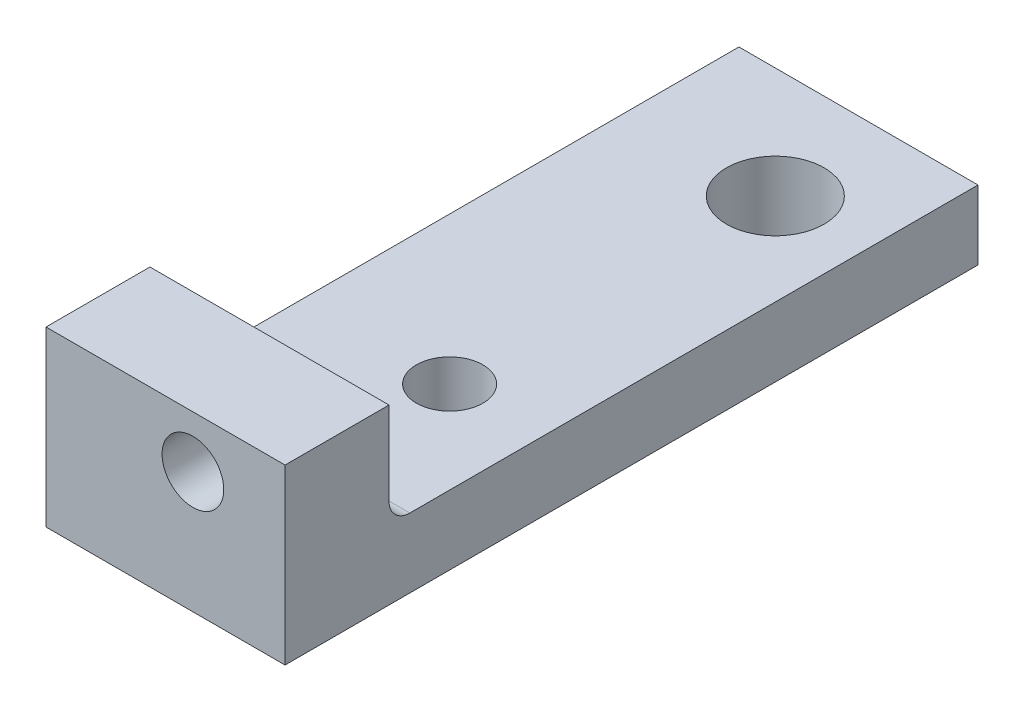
from build123d import *

# Parameters (mm, degrees)
SKETCH1_W                   = 11.43
SKETCH1_H                   = 8.89
EXTRUDE1_DEPTH              = 33.02
SKETCH3_W                   = 2.54
SKETCH3_H                   = 23.749
CUT_EXTRUDE1_DEPTH          = 35.734906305
SKETCH4_W                   = 8.89
SKETCH4_H                   = 23.749
CUT_EXTRUDE2_DEPTH          = 2.54
SKETCH5_W                   = 1.905
SKETCH5_H                   = 23.749
CUT_EXTRUDE3_DEPTH          = 35.17314905
CUT_EXTRUDE5_DEPTH          = 40.920041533
F_2_56_TAPPED_HOLE1_D       = 1.778
F_2_56_TAPPED_HOLE1_DEPTH   = 5.73278
SKETCH15_W                  = 23.749
SKETCH15_H                  = 6.35
EXTRUDE5_DEPTH              = 3.175
SKETCH6_R                   = 1.7907
CUT_EXTRUDE4_DEPTH          = 35.879712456
SKETCH16_W                  = 10.16
SKETCH16_H                  = 6.35
EXTRUDE6_DEPTH              = 9.398
F_41_0_096_DIAMETER_HOLE1_D = 2.4384
SKETCH19_W                  = 10.16
SKETCH19_H                  = 33.147
CUT_EXTRUDE7_DEPTH          = 0.762
CUT_EXTRUDE8_DEPTH          = 45.32008873
CUT_EXTRUDE9_DEPTH          = 1.143
SKETCH22_W                  = 33.147
SKETCH22_H                  = 5.588
CUT_EXTRUDE10_DEPTH         = 0.127
SKETCH23_W                  = 33.147
SKETCH23_H                  = 5.588
CUT_EXTRUDE11_DEPTH         = 1.27
EXTRUDE7_DEPTH              = 8.763
CUT_EXTRUDE12_DEPTH         = 55.048460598
CUT_EXTRUDE12_DEPTH_BACK    = 55.048460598
F_4_40_TAPPED_HOLE1_D       = 2.2606
FILLET1_R                   = 0.762


with BuildPart() as part:
    # Sketch1 → Extrude1 (new body)
    with BuildSketch(Plane.XY):
        with Locations((-0.381, 17.145)):
            Rectangle(SKETCH1_W, SKETCH1_H)
    extrude(amount=EXTRUDE1_DEPTH)

    # Sketch3 → Cut-Extrude1 (cut, through all)
    with BuildSketch(Plane(origin=(0, 21.59, 0), x_dir=(-1, 0, 0), z_dir=(0, 1, 0))):
        with Locations((-4.064, 21.1455)):
            Rectangle(SKETCH3_W, SKETCH3_H)
    extrude(amount=-CUT_EXTRUDE1_DEPTH, mode=Mode.SUBTRACT)

    # Sketch4 → Cut-Extrude2 (cut)
    with BuildSketch(Plane(origin=(0, 21.59, 0), x_dir=(-1, 0, 0), z_dir=(0, 1, 0))):
        with Locations((1.651, 21.1455)):
            Rectangle(SKETCH4_W, SKETCH4_H)
    extrude(amount=-CUT_EXTRUDE2_DEPTH, mode=Mode.SUBTRACT)

    # Sketch5 → Cut-Extrude3 (cut, through all)
    with BuildSketch(Plane(origin=(0, 19.05, 0), x_dir=(-1, 0, 0), z_dir=(0, 1, 0))):
        with Locations((-1.8415, 21.1455)):
            Rectangle(SKETCH5_W, SKETCH5_H)
    extrude(amount=-CUT_EXTRUDE3_DEPTH, mode=Mode.SUBTRACT)

    # Sketch7 → Cut-Extrude5 (cut, through all)
    with BuildSketch(Plane(origin=(0, 0, 0), x_dir=(1, 0, 0), z_dir=(0, 1, 0))):
        Polygon((5.334, 0), (4.5228926, -9.271), (5.334, -9.271), align=None)
    extrude(amount=CUT_EXTRUDE5_DEPTH, mode=Mode.SUBTRACT)

    # 2-56 Tapped Hole1
    with Locations(Plane(origin=(0, 0, 0), x_dir=(-1, 0, 0), z_dir=(0, 0, -1))):
        with Locations((-2.794, 15.24), (3.556, 19.05)):
            Hole(F_2_56_TAPPED_HOLE1_D / 2, depth=F_2_56_TAPPED_HOLE1_DEPTH)

    # Sketch15 → Extrude5 (add)
    with BuildSketch(Plane.ZY.offset(6.096)):
        with Locations((21.1455, 15.875)):
            Rectangle(SKETCH15_W, SKETCH15_H)
    extrude(amount=EXTRUDE5_DEPTH)

    # Sketch6 → Cut-Extrude4 (cut, through all)
    with BuildSketch(Plane(origin=(0, 19.05, 0), x_dir=(-1, 0, 0), z_dir=(0, 1, 0))):
        with Locations(Location((2.6035, 27.432, 0), (0, 0, 90))):
            Circle(SKETCH6_R)
    extrude(amount=-CUT_EXTRUDE4_DEPTH, mode=Mode.SUBTRACT)

    # Sketch16 → Extrude6 (add)
    with BuildSketch(Plane.XY.offset(33.02)):
        with Locations((-4.191, 15.875)):
            Rectangle(SKETCH16_W, SKETCH16_H)
    extrude(amount=EXTRUDE6_DEPTH)

    # 41 _0.096_ Diameter Hole1 (through all)
    with Locations(Plane(origin=(0, 19.05, 0), x_dir=(-1, 0, 0), z_dir=(0, 1, 0))):
        with Locations((2.6035, 39.37)):
            Hole(F_41_0_096_DIAMETER_HOLE1_D / 2)

    # Sketch19 → Cut-Extrude7 (cut)
    with BuildSketch(Plane(origin=(0, 19.05, 0), x_dir=(-1, 0, 0), z_dir=(0, 1, 0))):
        with Locations((4.191, 25.8445)):
            Rectangle(SKETCH19_W, SKETCH19_H)
    extrude(amount=-CUT_EXTRUDE7_DEPTH, mode=Mode.SUBTRACT)

    # Sketch20 → Cut-Extrude8 (cut, through all)
    with BuildSketch(Plane.XZ.offset(-12.7)):
        Polygon((4.5228926, 9.271), (5.334, 0), (4.824059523, 0), (4.012952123, 9.271), align=None)
    extrude(amount=-CUT_EXTRUDE8_DEPTH, mode=Mode.SUBTRACT)

    # Sketch21 → Cut-Extrude9 (cut)
    with BuildSketch(Plane.ZY.offset(6.096)):
        Polygon((0, 12.7), (3.81, 12.7), (0, 16.51), align=None)
    extrude(amount=-CUT_EXTRUDE9_DEPTH, mode=Mode.SUBTRACT)

    # Sketch22 → Cut-Extrude10 (cut)
    with BuildSketch(Plane.ZY.offset(-0.889)):
        with Locations((25.8445, 15.494)):
            Rectangle(SKETCH22_W, SKETCH22_H)
    extrude(amount=CUT_EXTRUDE10_DEPTH, mode=Mode.SUBTRACT)

    # Sketch23 → Cut-Extrude11 (cut)
    with BuildSketch(Plane.ZY.offset(9.271)):
        with Locations((25.8445, 15.494)):
            Rectangle(SKETCH23_W, SKETCH23_H)
    extrude(amount=-CUT_EXTRUDE11_DEPTH, mode=Mode.SUBTRACT)

    # Sketch24 → Extrude7 (add)
    with BuildSketch(Plane(origin=(0.762, 0, 0), x_dir=(0, 0, -1), z_dir=(1, 0, 0))):
        Polygon((-42.418, 12.7), (-48.768, 12.7), (-48.768, 19.05), (-44.958, 19.05), (-44.958, 15.24), (-42.418, 15.24), align=None)
    extrude(amount=-EXTRUDE7_DEPTH)

    # Sketch25 → Cut-Extrude12 (cut, two sides: drawn at the far end of the back side and taken through both)
    with BuildSketch(Plane(origin=(0.762, 0, 0), x_dir=(0, 0, -1), z_dir=(1, 0, 0)).offset(-CUT_EXTRUDE12_DEPTH_BACK)):
        Polygon((-42.418, 15.24), (-23.368, 15.24), (-23.368, 12.7), (3.406234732, 12.7), (3.406234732, 25.529221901), (-42.418, 25.529221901), align=None)
    extrude(amount=CUT_EXTRUDE12_DEPTH + CUT_EXTRUDE12_DEPTH_BACK, mode=Mode.SUBTRACT)

    # 4-40 Tapped Hole1 (through all)
    with Locations(Plane(origin=(-2.6162, 17.145, 48.768), x_dir=(1, 0, 0), z_dir=(0, 0, 1))):
        with Locations((0, 0)):
            Hole(F_4_40_TAPPED_HOLE1_D / 2)

    # Fillet1
    fillet1_edges = [part.edges().sort_by_distance(p)[0] for p in [
        (-3.6195, 15.24, 44.958),
    ]]
    fillet(fillet1_edges, radius=FILLET1_R)


solid = part.part
